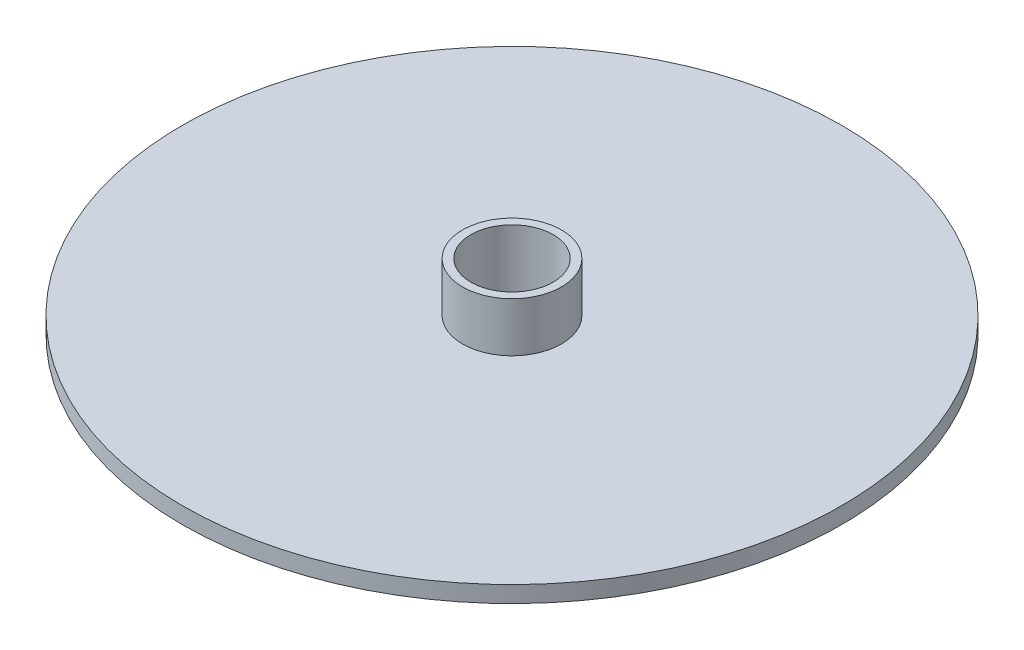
from build123d import *

# Parameters (mm, degrees)
SKETCH1_R           = 1000
BOSS_EXTRUDE1_DEPTH = 50
SKETCH4_R           = 125
CUT_EXTRUDE5_DEPTH  = 50
BOSS_EXTRUDE2_START = 150
SKETCH5_R           = 150
SKETCH5_R_2         = 125
BOSS_EXTRUDE2_DEPTH = 150


with BuildPart() as part:
    # Sketch1 → Boss-Extrude1 (new body)
    with BuildSketch(Plane(origin=(0, 0, 0), x_dir=(1, 0, 0), z_dir=(0, 1, 0))):
        with Locations(Location((0, 0, 0), (0, 0, 270))):
            Circle(SKETCH1_R)
    extrude(amount=BOSS_EXTRUDE1_DEPTH)

    # Sketch4 → Cut-Extrude5 (cut)
    with BuildSketch(Plane(origin=(0, 50, 0), x_dir=(1, 0, 0), z_dir=(0, 1, 0))):
        with Locations(Location((0, 0, 0), (0, 0, 270))):
            Circle(SKETCH4_R)
    extrude(amount=-CUT_EXTRUDE5_DEPTH, mode=Mode.SUBTRACT)

    # Sketch5 → Boss-Extrude2 (add)
    with BuildSketch(Plane(origin=(0, 50, 0), x_dir=(1, 0, 0), z_dir=(0, 1, 0)).offset(BOSS_EXTRUDE2_START)):
        with Locations(Location((0, 0, 0), (0, 0, 270))):
            Circle(SKETCH5_R)
        with Locations(Location((0, 0, 0), (0, 0, 270))):
            Circle(SKETCH5_R_2, mode=Mode.SUBTRACT)
    extrude(amount=-BOSS_EXTRUDE2_DEPTH)


solid = part.part
